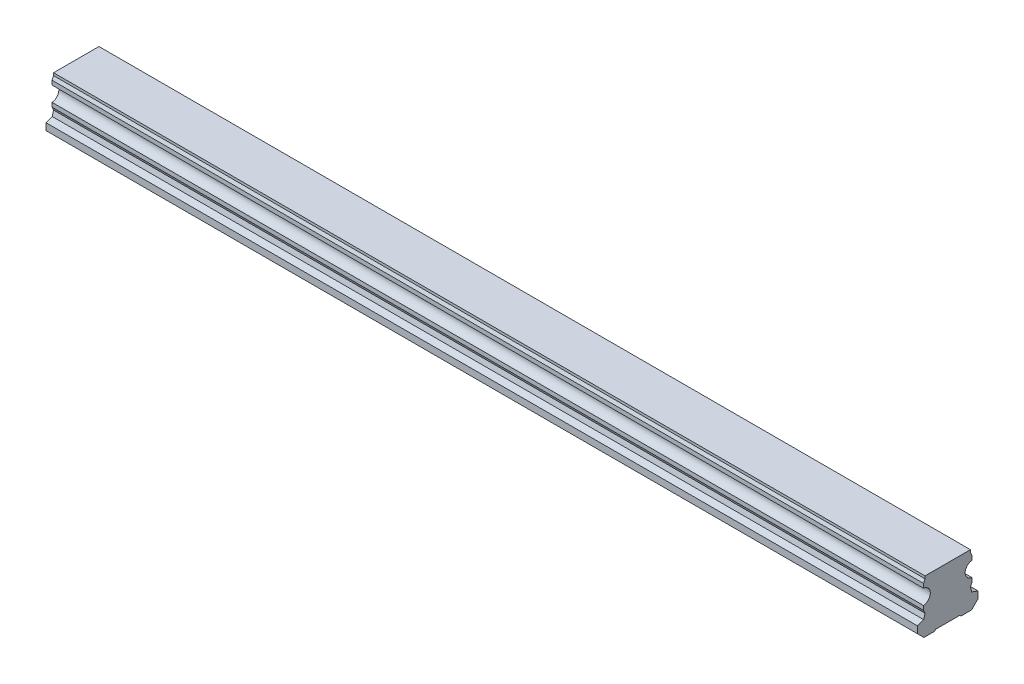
ISO-10303-21;
HEADER;
FILE_DESCRIPTION(('STEP AP214'),'2;1');
FILE_NAME('part.step','',(''),(''),'','','');
FILE_SCHEMA(('AUTOMOTIVE_DESIGN { 1 0 10303 214 1 1 1 1 }'));
ENDSEC;
DATA;
#1=APPLICATION_CONTEXT('core data for automotive mechanical design processes');
#2=APPLICATION_PROTOCOL_DEFINITION('international standard','automotive_design',2000,#1);
#3=PRODUCT_CONTEXT('',#1,'mechanical');
#4=PRODUCT('Part','Part','',(#3));
#5=PRODUCT_RELATED_PRODUCT_CATEGORY('part','',(#4));
#6=PRODUCT_DEFINITION_FORMATION('','',#4);
#7=PRODUCT_DEFINITION_CONTEXT('part definition',#1,'design');
#8=PRODUCT_DEFINITION('design','',#6,#7);
#9=PRODUCT_DEFINITION_SHAPE('','',#8);
#10=(LENGTH_UNIT() NAMED_UNIT(*) SI_UNIT(.MILLI.,.METRE.));
#11=(NAMED_UNIT(*) PLANE_ANGLE_UNIT() SI_UNIT($,.RADIAN.));
#12=(NAMED_UNIT(*) SI_UNIT($,.STERADIAN.) SOLID_ANGLE_UNIT());
#13=UNCERTAINTY_MEASURE_WITH_UNIT(LENGTH_MEASURE(1.E-05),#10,'distance_accuracy_value','');
#14=(GEOMETRIC_REPRESENTATION_CONTEXT(3) GLOBAL_UNCERTAINTY_ASSIGNED_CONTEXT((#13)) GLOBAL_UNIT_ASSIGNED_CONTEXT((#10,
#11,#12)) REPRESENTATION_CONTEXT('',''));
#15=CARTESIAN_POINT('',(0.,0.,0.));
#16=DIRECTION('',(0.,0.,1.));
#17=DIRECTION('',(1.,0.,0.));
#18=AXIS2_PLACEMENT_3D('',#15,#16,#17);
#19=CARTESIAN_POINT('',(330.,0.499999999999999,0.));
#20=DIRECTION('',(0.,-1.,0.));
#21=DIRECTION('',(0.,0.,-1.));
#22=AXIS2_PLACEMENT_3D('',#19,#20,#21);
#23=CONICAL_SURFACE('',#22,3.5,0.785398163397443);
#24=CARTESIAN_POINT('',(330.,1.00000000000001,0.));
#25=DIRECTION('',(0.,1.,0.));
#26=DIRECTION('',(0.,0.,1.));
#27=AXIS2_PLACEMENT_3D('',#24,#25,#26);
#28=CIRCLE('',#27,3.);
#29=CARTESIAN_POINT('',(330.,1.00000000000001,3.));
#30=VERTEX_POINT('',#29);
#31=EDGE_CURVE('E11',#30,#30,#28,.F.);
#32=ORIENTED_EDGE('',*,*,#31,.F.);
#33=EDGE_LOOP('',(#32));
#34=FACE_BOUND('',#33,.T.);
#35=CARTESIAN_POINT('',(330.,0.499999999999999,0.));
#36=DIRECTION('',(0.,1.,0.));
#37=DIRECTION('',(0.,0.,1.));
#38=AXIS2_PLACEMENT_3D('',#35,#36,#37);
#39=CIRCLE('',#38,3.5);
#40=CARTESIAN_POINT('',(330.,0.5,3.5));
#41=VERTEX_POINT('',#40);
#42=EDGE_CURVE('E469',#41,#41,#39,.T.);
#43=ORIENTED_EDGE('',*,*,#42,.F.);
#44=EDGE_LOOP('',(#43));
#45=FACE_BOUND('',#44,.T.);
#46=ADVANCED_FACE('F39',(#34,#45),#23,.F.);
#47=CARTESIAN_POINT('',(330.,12.,0.));
#48=DIRECTION('',(0.,-1.,0.));
#49=DIRECTION('',(0.,0.,-1.));
#50=AXIS2_PLACEMENT_3D('',#47,#48,#49);
#51=CYLINDRICAL_SURFACE('',#50,3.);
#52=ORIENTED_EDGE('',*,*,#31,.T.);
#53=EDGE_LOOP('',(#52));
#54=FACE_BOUND('',#53,.T.);
#55=CARTESIAN_POINT('',(330.,12.,0.));
#56=DIRECTION('',(0.,-1.,0.));
#57=DIRECTION('',(0.,0.,-1.));
#58=AXIS2_PLACEMENT_3D('',#55,#56,#57);
#59=CIRCLE('',#58,3.);
#60=CARTESIAN_POINT('',(330.,12.,-3.));
#61=VERTEX_POINT('',#60);
#62=EDGE_CURVE('E49',#61,#61,#59,.T.);
#63=ORIENTED_EDGE('',*,*,#62,.F.);
#64=EDGE_LOOP('',(#63));
#65=FACE_BOUND('',#64,.T.);
#66=ADVANCED_FACE('F619',(#54,#65),#51,.F.);
#67=CARTESIAN_POINT('',(330.,12.,0.));
#68=DIRECTION('',(0.,-1.,0.));
#69=DIRECTION('',(0.,0.,-1.));
#70=AXIS2_PLACEMENT_3D('',#67,#68,#69);
#71=PLANE('',#70);
#72=CARTESIAN_POINT('',(330.,12.,0.));
#73=DIRECTION('',(0.,-1.,0.));
#74=DIRECTION('',(0.,0.,-1.));
#75=AXIS2_PLACEMENT_3D('',#72,#73,#74);
#76=CIRCLE('',#75,2.5);
#77=CARTESIAN_POINT('',(330.,12.,-2.5));
#78=VERTEX_POINT('',#77);
#79=EDGE_CURVE('E42',#78,#78,#76,.T.);
#80=ORIENTED_EDGE('',*,*,#79,.F.);
#81=EDGE_LOOP('',(#80));
#82=FACE_BOUND('',#81,.T.);
#83=ORIENTED_EDGE('',*,*,#62,.T.);
#84=EDGE_LOOP('',(#83));
#85=FACE_BOUND('',#84,.T.);
#86=ADVANCED_FACE('F624',(#82,#85),#71,.T.);
#87=CARTESIAN_POINT('',(270.,0.499999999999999,0.));
#88=DIRECTION('',(0.,-1.,0.));
#89=DIRECTION('',(0.,0.,-1.));
#90=AXIS2_PLACEMENT_3D('',#87,#88,#89);
#91=CONICAL_SURFACE('',#90,3.5,0.785398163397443);
#92=CARTESIAN_POINT('',(270.,1.00000000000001,0.));
#93=DIRECTION('',(0.,1.,0.));
#94=DIRECTION('',(0.,0.,1.));
#95=AXIS2_PLACEMENT_3D('',#92,#93,#94);
#96=CIRCLE('',#95,3.);
#97=CARTESIAN_POINT('',(270.,1.00000000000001,3.));
#98=VERTEX_POINT('',#97);
#99=EDGE_CURVE('E465',#98,#98,#96,.F.);
#100=ORIENTED_EDGE('',*,*,#99,.F.);
#101=EDGE_LOOP('',(#100));
#102=FACE_BOUND('',#101,.T.);
#103=CARTESIAN_POINT('',(270.,0.499999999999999,0.));
#104=DIRECTION('',(0.,1.,0.));
#105=DIRECTION('',(0.,0.,1.));
#106=AXIS2_PLACEMENT_3D('',#103,#104,#105);
#107=CIRCLE('',#106,3.5);
#108=CARTESIAN_POINT('',(270.,0.5,3.5));
#109=VERTEX_POINT('',#108);
#110=EDGE_CURVE('E457',#109,#109,#107,.T.);
#111=ORIENTED_EDGE('',*,*,#110,.F.);
#112=EDGE_LOOP('',(#111));
#113=FACE_BOUND('',#112,.T.);
#114=ADVANCED_FACE('F733',(#102,#113),#91,.F.);
#115=CARTESIAN_POINT('',(270.,12.,0.));
#116=DIRECTION('',(0.,-1.,0.));
#117=DIRECTION('',(0.,0.,-1.));
#118=AXIS2_PLACEMENT_3D('',#115,#116,#117);
#119=CYLINDRICAL_SURFACE('',#118,3.);
#120=ORIENTED_EDGE('',*,*,#99,.T.);
#121=EDGE_LOOP('',(#120));
#122=FACE_BOUND('',#121,.T.);
#123=CARTESIAN_POINT('',(270.,12.,0.));
#124=DIRECTION('',(0.,-1.,0.));
#125=DIRECTION('',(0.,0.,-1.));
#126=AXIS2_PLACEMENT_3D('',#123,#124,#125);
#127=CIRCLE('',#126,3.);
#128=CARTESIAN_POINT('',(270.,12.,-3.));
#129=VERTEX_POINT('',#128);
#130=EDGE_CURVE('E461',#129,#129,#127,.T.);
#131=ORIENTED_EDGE('',*,*,#130,.F.);
#132=EDGE_LOOP('',(#131));
#133=FACE_BOUND('',#132,.T.);
#134=ADVANCED_FACE('F729',(#122,#133),#119,.F.);
#135=CARTESIAN_POINT('',(270.,12.,0.));
#136=DIRECTION('',(0.,-1.,0.));
#137=DIRECTION('',(0.,0.,-1.));
#138=AXIS2_PLACEMENT_3D('',#135,#136,#137);
#139=PLANE('',#138);
#140=CARTESIAN_POINT('',(270.,12.,0.));
#141=DIRECTION('',(0.,-1.,0.));
#142=DIRECTION('',(0.,0.,-1.));
#143=AXIS2_PLACEMENT_3D('',#140,#141,#142);
#144=CIRCLE('',#143,2.5);
#145=CARTESIAN_POINT('',(270.,12.,-2.5));
#146=VERTEX_POINT('',#145);
#147=EDGE_CURVE('E488',#146,#146,#144,.T.);
#148=ORIENTED_EDGE('',*,*,#147,.F.);
#149=EDGE_LOOP('',(#148));
#150=FACE_BOUND('',#149,.T.);
#151=ORIENTED_EDGE('',*,*,#130,.T.);
#152=EDGE_LOOP('',(#151));
#153=FACE_BOUND('',#152,.T.);
#154=ADVANCED_FACE('F725',(#150,#153),#139,.T.);
#155=CARTESIAN_POINT('',(210.,0.499999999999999,0.));
#156=DIRECTION('',(0.,-1.,0.));
#157=DIRECTION('',(0.,0.,-1.));
#158=AXIS2_PLACEMENT_3D('',#155,#156,#157);
#159=CONICAL_SURFACE('',#158,3.5,0.785398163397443);
#160=CARTESIAN_POINT('',(210.,1.00000000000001,0.));
#161=DIRECTION('',(0.,1.,0.));
#162=DIRECTION('',(0.,0.,1.));
#163=AXIS2_PLACEMENT_3D('',#160,#161,#162);
#164=CIRCLE('',#163,3.);
#165=CARTESIAN_POINT('',(210.,1.00000000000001,3.));
#166=VERTEX_POINT('',#165);
#167=EDGE_CURVE('E453',#166,#166,#164,.F.);
#168=ORIENTED_EDGE('',*,*,#167,.F.);
#169=EDGE_LOOP('',(#168));
#170=FACE_BOUND('',#169,.T.);
#171=CARTESIAN_POINT('',(210.,0.499999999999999,0.));
#172=DIRECTION('',(0.,1.,0.));
#173=DIRECTION('',(0.,0.,1.));
#174=AXIS2_PLACEMENT_3D('',#171,#172,#173);
#175=CIRCLE('',#174,3.5);
#176=CARTESIAN_POINT('',(210.,0.5,3.5));
#177=VERTEX_POINT('',#176);
#178=EDGE_CURVE('E445',#177,#177,#175,.T.);
#179=ORIENTED_EDGE('',*,*,#178,.F.);
#180=EDGE_LOOP('',(#179));
#181=FACE_BOUND('',#180,.T.);
#182=ADVANCED_FACE('F721',(#170,#181),#159,.F.);
#183=CARTESIAN_POINT('',(210.,12.,0.));
#184=DIRECTION('',(0.,-1.,0.));
#185=DIRECTION('',(0.,0.,-1.));
#186=AXIS2_PLACEMENT_3D('',#183,#184,#185);
#187=CYLINDRICAL_SURFACE('',#186,3.);
#188=ORIENTED_EDGE('',*,*,#167,.T.);
#189=EDGE_LOOP('',(#188));
#190=FACE_BOUND('',#189,.T.);
#191=CARTESIAN_POINT('',(210.,12.,0.));
#192=DIRECTION('',(0.,-1.,0.));
#193=DIRECTION('',(0.,0.,-1.));
#194=AXIS2_PLACEMENT_3D('',#191,#192,#193);
#195=CIRCLE('',#194,3.);
#196=CARTESIAN_POINT('',(210.,12.,-3.));
#197=VERTEX_POINT('',#196);
#198=EDGE_CURVE('E449',#197,#197,#195,.T.);
#199=ORIENTED_EDGE('',*,*,#198,.F.);
#200=EDGE_LOOP('',(#199));
#201=FACE_BOUND('',#200,.T.);
#202=ADVANCED_FACE('F717',(#190,#201),#187,.F.);
#203=CARTESIAN_POINT('',(210.,12.,0.));
#204=DIRECTION('',(0.,-1.,0.));
#205=DIRECTION('',(0.,0.,-1.));
#206=AXIS2_PLACEMENT_3D('',#203,#204,#205);
#207=PLANE('',#206);
#208=CARTESIAN_POINT('',(210.,12.,0.));
#209=DIRECTION('',(0.,-1.,0.));
#210=DIRECTION('',(0.,0.,-1.));
#211=AXIS2_PLACEMENT_3D('',#208,#209,#210);
#212=CIRCLE('',#211,2.5);
#213=CARTESIAN_POINT('',(210.,12.,-2.5));
#214=VERTEX_POINT('',#213);
#215=EDGE_CURVE('E485',#214,#214,#212,.T.);
#216=ORIENTED_EDGE('',*,*,#215,.F.);
#217=EDGE_LOOP('',(#216));
#218=FACE_BOUND('',#217,.T.);
#219=ORIENTED_EDGE('',*,*,#198,.T.);
#220=EDGE_LOOP('',(#219));
#221=FACE_BOUND('',#220,.T.);
#222=ADVANCED_FACE('F713',(#218,#221),#207,.T.);
#223=CARTESIAN_POINT('',(150.,0.499999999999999,0.));
#224=DIRECTION('',(0.,-1.,0.));
#225=DIRECTION('',(0.,0.,-1.));
#226=AXIS2_PLACEMENT_3D('',#223,#224,#225);
#227=CONICAL_SURFACE('',#226,3.5,0.785398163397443);
#228=CARTESIAN_POINT('',(150.,1.00000000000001,0.));
#229=DIRECTION('',(0.,1.,0.));
#230=DIRECTION('',(0.,0.,1.));
#231=AXIS2_PLACEMENT_3D('',#228,#229,#230);
#232=CIRCLE('',#231,3.);
#233=CARTESIAN_POINT('',(150.,1.00000000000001,3.));
#234=VERTEX_POINT('',#233);
#235=EDGE_CURVE('E441',#234,#234,#232,.F.);
#236=ORIENTED_EDGE('',*,*,#235,.F.);
#237=EDGE_LOOP('',(#236));
#238=FACE_BOUND('',#237,.T.);
#239=CARTESIAN_POINT('',(150.,0.499999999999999,0.));
#240=DIRECTION('',(0.,1.,0.));
#241=DIRECTION('',(0.,0.,1.));
#242=AXIS2_PLACEMENT_3D('',#239,#240,#241);
#243=CIRCLE('',#242,3.5);
#244=CARTESIAN_POINT('',(150.,0.5,3.5));
#245=VERTEX_POINT('',#244);
#246=EDGE_CURVE('E433',#245,#245,#243,.T.);
#247=ORIENTED_EDGE('',*,*,#246,.F.);
#248=EDGE_LOOP('',(#247));
#249=FACE_BOUND('',#248,.T.);
#250=ADVANCED_FACE('F709',(#238,#249),#227,.F.);
#251=CARTESIAN_POINT('',(150.,12.,0.));
#252=DIRECTION('',(0.,-1.,0.));
#253=DIRECTION('',(0.,0.,-1.));
#254=AXIS2_PLACEMENT_3D('',#251,#252,#253);
#255=CYLINDRICAL_SURFACE('',#254,3.);
#256=ORIENTED_EDGE('',*,*,#235,.T.);
#257=EDGE_LOOP('',(#256));
#258=FACE_BOUND('',#257,.T.);
#259=CARTESIAN_POINT('',(150.,12.,0.));
#260=DIRECTION('',(0.,-1.,0.));
#261=DIRECTION('',(0.,0.,-1.));
#262=AXIS2_PLACEMENT_3D('',#259,#260,#261);
#263=CIRCLE('',#262,3.);
#264=CARTESIAN_POINT('',(150.,12.,-3.));
#265=VERTEX_POINT('',#264);
#266=EDGE_CURVE('E437',#265,#265,#263,.T.);
#267=ORIENTED_EDGE('',*,*,#266,.F.);
#268=EDGE_LOOP('',(#267));
#269=FACE_BOUND('',#268,.T.);
#270=ADVANCED_FACE('F705',(#258,#269),#255,.F.);
#271=CARTESIAN_POINT('',(150.,12.,0.));
#272=DIRECTION('',(0.,-1.,0.));
#273=DIRECTION('',(0.,0.,-1.));
#274=AXIS2_PLACEMENT_3D('',#271,#272,#273);
#275=PLANE('',#274);
#276=CARTESIAN_POINT('',(150.,12.,0.));
#277=DIRECTION('',(0.,-1.,0.));
#278=DIRECTION('',(0.,0.,-1.));
#279=AXIS2_PLACEMENT_3D('',#276,#277,#278);
#280=CIRCLE('',#279,2.5);
#281=CARTESIAN_POINT('',(150.,12.,-2.5));
#282=VERTEX_POINT('',#281);
#283=EDGE_CURVE('E480',#282,#282,#280,.T.);
#284=ORIENTED_EDGE('',*,*,#283,.F.);
#285=EDGE_LOOP('',(#284));
#286=FACE_BOUND('',#285,.T.);
#287=ORIENTED_EDGE('',*,*,#266,.T.);
#288=EDGE_LOOP('',(#287));
#289=FACE_BOUND('',#288,.T.);
#290=ADVANCED_FACE('F696',(#286,#289),#275,.T.);
#291=CARTESIAN_POINT('',(360.,21.8,-9.375));
#292=DIRECTION('',(0.,0.,1.));
#293=DIRECTION('',(0.,-1.,0.));
#294=AXIS2_PLACEMENT_3D('',#291,#292,#293);
#295=PLANE('',#294);
#296=DIRECTION('',(0.,1.,0.));
#297=VECTOR('',#296,1.);
#298=CARTESIAN_POINT('',(0.,21.8,-9.375));
#299=LINE('',#298,#297);
#300=CARTESIAN_POINT('',(0.,20.756,-9.375));
#301=VERTEX_POINT('',#300);
#302=CARTESIAN_POINT('',(0.,21.8,-9.375));
#303=VERTEX_POINT('',#302);
#304=EDGE_CURVE('E255',#301,#303,#299,.T.);
#305=ORIENTED_EDGE('',*,*,#304,.T.);
#306=DIRECTION('',(-1.,0.,0.));
#307=VECTOR('',#306,1.);
#308=CARTESIAN_POINT('',(360.,21.8,-9.375));
#309=LINE('',#308,#307);
#310=CARTESIAN_POINT('',(360.,21.8,-9.375));
#311=VERTEX_POINT('',#310);
#312=EDGE_CURVE('E422',#311,#303,#309,.T.);
#313=ORIENTED_EDGE('',*,*,#312,.F.);
#314=DIRECTION('',(0.,1.,0.));
#315=VECTOR('',#314,1.);
#316=CARTESIAN_POINT('',(360.,21.8,-9.375));
#317=LINE('',#316,#315);
#318=CARTESIAN_POINT('',(360.,20.756,-9.375));
#319=VERTEX_POINT('',#318);
#320=EDGE_CURVE('E331',#319,#311,#317,.T.);
#321=ORIENTED_EDGE('',*,*,#320,.F.);
#322=DIRECTION('',(-1.,0.,0.));
#323=VECTOR('',#322,1.);
#324=CARTESIAN_POINT('',(360.,20.756,-9.375));
#325=LINE('',#324,#323);
#326=EDGE_CURVE('E251',#319,#301,#325,.T.);
#327=ORIENTED_EDGE('',*,*,#326,.T.);
#328=EDGE_LOOP('',(#305,#313,#321,#327));
#329=FACE_BOUND('',#328,.T.);
#330=ADVANCED_FACE('F606',(#329),#295,.F.);
#331=CARTESIAN_POINT('',(360.,21.8,-9.375));
#332=DIRECTION('',(0.,-1.,0.));
#333=DIRECTION('',(0.,0.,-1.));
#334=AXIS2_PLACEMENT_3D('',#331,#332,#333);
#335=PLANE('',#334);
#336=DIRECTION('',(0.,0.,1.));
#337=VECTOR('',#336,1.);
#338=CARTESIAN_POINT('',(0.,21.8,-9.375));
#339=LINE('',#338,#337);
#340=CARTESIAN_POINT('',(0.,21.8,9.375));
#341=VERTEX_POINT('',#340);
#342=EDGE_CURVE('E259',#303,#341,#339,.T.);
#343=ORIENTED_EDGE('',*,*,#342,.T.);
#344=DIRECTION('',(-1.,0.,0.));
#345=VECTOR('',#344,1.);
#346=CARTESIAN_POINT('',(360.,21.8,9.375));
#347=LINE('',#346,#345);
#348=CARTESIAN_POINT('',(360.,21.8,9.375));
#349=VERTEX_POINT('',#348);
#350=EDGE_CURVE('E418',#349,#341,#347,.T.);
#351=ORIENTED_EDGE('',*,*,#350,.F.);
#352=DIRECTION('',(0.,0.,1.));
#353=VECTOR('',#352,1.);
#354=CARTESIAN_POINT('',(360.,21.8,-9.375));
#355=LINE('',#354,#353);
#356=EDGE_CURVE('E157',#311,#349,#355,.T.);
#357=ORIENTED_EDGE('',*,*,#356,.F.);
#358=ORIENTED_EDGE('',*,*,#312,.T.);
#359=EDGE_LOOP('',(#343,#351,#357,#358));
#360=FACE_BOUND('',#359,.T.);
#361=ADVANCED_FACE('F690',(#360),#335,.F.);
#362=CARTESIAN_POINT('',(360.,21.8,9.375));
#363=DIRECTION('',(0.,0.,-1.));
#364=DIRECTION('',(0.,1.,0.));
#365=AXIS2_PLACEMENT_3D('',#362,#363,#364);
#366=PLANE('',#365);
#367=DIRECTION('',(0.,-1.,0.));
#368=VECTOR('',#367,1.);
#369=CARTESIAN_POINT('',(0.,21.8,9.375));
#370=LINE('',#369,#368);
#371=CARTESIAN_POINT('',(0.,20.756,9.37499999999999));
#372=VERTEX_POINT('',#371);
#373=EDGE_CURVE('E263',#341,#372,#370,.T.);
#374=ORIENTED_EDGE('',*,*,#373,.T.);
#375=DIRECTION('',(-1.,0.,0.));
#376=VECTOR('',#375,1.);
#377=CARTESIAN_POINT('',(360.,20.756,9.37499999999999));
#378=LINE('',#377,#376);
#379=CARTESIAN_POINT('',(360.,20.756,9.37499999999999));
#380=VERTEX_POINT('',#379);
#381=EDGE_CURVE('E414',#380,#372,#378,.T.);
#382=ORIENTED_EDGE('',*,*,#381,.F.);
#383=DIRECTION('',(0.,-1.,0.));
#384=VECTOR('',#383,1.);
#385=CARTESIAN_POINT('',(360.,21.8,9.375));
#386=LINE('',#385,#384);
#387=EDGE_CURVE('E530',#349,#380,#386,.T.);
#388=ORIENTED_EDGE('',*,*,#387,.F.);
#389=ORIENTED_EDGE('',*,*,#350,.T.);
#390=EDGE_LOOP('',(#374,#382,#388,#389));
#391=FACE_BOUND('',#390,.T.);
#392=ADVANCED_FACE('F686',(#391),#366,.F.);
#393=CARTESIAN_POINT('',(360.,20.756,9.37499999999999));
#394=DIRECTION('',(0.,-0.422618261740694,-0.906307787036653));
#395=DIRECTION('',(0.,0.906307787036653,-0.422618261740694));
#396=AXIS2_PLACEMENT_3D('',#393,#394,#395);
#397=PLANE('',#396);
#398=DIRECTION('',(0.,-0.906307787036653,0.422618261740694));
#399=VECTOR('',#398,1.);
#400=CARTESIAN_POINT('',(0.,20.756,9.37499999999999));
#401=LINE('',#400,#399);
#402=CARTESIAN_POINT('',(0.,19.4156831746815,10.));
#403=VERTEX_POINT('',#402);
#404=EDGE_CURVE('E266',#372,#403,#401,.T.);
#405=ORIENTED_EDGE('',*,*,#404,.T.);
#406=DIRECTION('',(-1.,0.,0.));
#407=VECTOR('',#406,1.);
#408=CARTESIAN_POINT('',(360.,19.4156831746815,10.));
#409=LINE('',#408,#407);
#410=CARTESIAN_POINT('',(360.,19.4156831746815,10.));
#411=VERTEX_POINT('',#410);
#412=EDGE_CURVE('E410',#411,#403,#409,.T.);
#413=ORIENTED_EDGE('',*,*,#412,.F.);
#414=DIRECTION('',(0.,-0.906307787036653,0.422618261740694));
#415=VECTOR('',#414,1.);
#416=CARTESIAN_POINT('',(360.,20.756,9.37499999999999));
#417=LINE('',#416,#415);
#418=EDGE_CURVE('E533',#380,#411,#417,.T.);
#419=ORIENTED_EDGE('',*,*,#418,.F.);
#420=ORIENTED_EDGE('',*,*,#381,.T.);
#421=EDGE_LOOP('',(#405,#413,#419,#420));
#422=FACE_BOUND('',#421,.T.);
#423=ADVANCED_FACE('F682',(#422),#397,.F.);
#424=CARTESIAN_POINT('',(360.,19.4156831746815,10.));
#425=DIRECTION('',(0.,0.,-1.));
#426=DIRECTION('',(-1.,0.,0.));
#427=AXIS2_PLACEMENT_3D('',#424,#425,#426);
#428=PLANE('',#427);
#429=DIRECTION('',(0.,-1.,0.));
#430=VECTOR('',#429,1.);
#431=CARTESIAN_POINT('',(0.,19.4156831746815,10.));
#432=LINE('',#431,#430);
#433=CARTESIAN_POINT('',(0.,17.6854497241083,10.));
#434=VERTEX_POINT('',#433);
#435=EDGE_CURVE('E269',#403,#434,#432,.T.);
#436=ORIENTED_EDGE('',*,*,#435,.T.);
#437=DIRECTION('',(-1.,0.,0.));
#438=VECTOR('',#437,1.);
#439=CARTESIAN_POINT('',(360.,17.6854497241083,10.));
#440=LINE('',#439,#438);
#441=CARTESIAN_POINT('',(360.,17.6854497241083,10.));
#442=VERTEX_POINT('',#441);
#443=EDGE_CURVE('E406',#442,#434,#440,.T.);
#444=ORIENTED_EDGE('',*,*,#443,.F.);
#445=DIRECTION('',(0.,-1.,0.));
#446=VECTOR('',#445,1.);
#447=CARTESIAN_POINT('',(360.,19.4156831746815,10.));
#448=LINE('',#447,#446);
#449=EDGE_CURVE('E536',#411,#442,#448,.T.);
#450=ORIENTED_EDGE('',*,*,#449,.F.);
#451=ORIENTED_EDGE('',*,*,#412,.T.);
#452=EDGE_LOOP('',(#436,#444,#450,#451));
#453=FACE_BOUND('',#452,.T.);
#454=ADVANCED_FACE('F678',(#453),#428,.F.);
#455=CARTESIAN_POINT('',(360.,14.6,10.3));
#456=DIRECTION('',(-1.,0.,0.));
#457=DIRECTION('',(0.,0.,1.));
#458=AXIS2_PLACEMENT_3D('',#455,#456,#457);
#459=CYLINDRICAL_SURFACE('',#458,3.1);
#460=CARTESIAN_POINT('',(0.,14.6,10.3));
#461=DIRECTION('',(-1.,0.,0.));
#462=DIRECTION('',(0.,0.,-1.));
#463=AXIS2_PLACEMENT_3D('',#460,#461,#462);
#464=CIRCLE('',#463,3.1);
#465=CARTESIAN_POINT('',(0.,11.5145502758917,10.));
#466=VERTEX_POINT('',#465);
#467=EDGE_CURVE('E272',#434,#466,#464,.T.);
#468=ORIENTED_EDGE('',*,*,#467,.T.);
#469=DIRECTION('',(-1.,0.,0.));
#470=VECTOR('',#469,1.);
#471=CARTESIAN_POINT('',(360.,11.5145502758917,10.));
#472=LINE('',#471,#470);
#473=CARTESIAN_POINT('',(360.,11.5145502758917,10.));
#474=VERTEX_POINT('',#473);
#475=EDGE_CURVE('E402',#474,#466,#472,.T.);
#476=ORIENTED_EDGE('',*,*,#475,.F.);
#477=CARTESIAN_POINT('',(360.,14.6,10.3));
#478=DIRECTION('',(-1.,0.,0.));
#479=DIRECTION('',(0.,0.,-1.));
#480=AXIS2_PLACEMENT_3D('',#477,#478,#479);
#481=CIRCLE('',#480,3.1);
#482=EDGE_CURVE('E539',#442,#474,#481,.T.);
#483=ORIENTED_EDGE('',*,*,#482,.F.);
#484=ORIENTED_EDGE('',*,*,#443,.T.);
#485=EDGE_LOOP('',(#468,#476,#483,#484));
#486=FACE_BOUND('',#485,.T.);
#487=ADVANCED_FACE('F674',(#486),#459,.F.);
#488=CARTESIAN_POINT('',(360.,9.78431682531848,10.));
#489=DIRECTION('',(0.,0.,-1.));
#490=DIRECTION('',(0.,1.,0.));
#491=AXIS2_PLACEMENT_3D('',#488,#489,#490);
#492=PLANE('',#491);
#493=DIRECTION('',(0.,-1.,0.));
#494=VECTOR('',#493,1.);
#495=CARTESIAN_POINT('',(0.,9.78431682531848,10.));
#496=LINE('',#495,#494);
#497=CARTESIAN_POINT('',(0.,9.78431682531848,10.));
#498=VERTEX_POINT('',#497);
#499=EDGE_CURVE('E275',#466,#498,#496,.T.);
#500=ORIENTED_EDGE('',*,*,#499,.T.);
#501=DIRECTION('',(-1.,0.,0.));
#502=VECTOR('',#501,1.);
#503=CARTESIAN_POINT('',(360.,9.78431682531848,10.));
#504=LINE('',#503,#502);
#505=CARTESIAN_POINT('',(360.,9.78431682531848,10.));
#506=VERTEX_POINT('',#505);
#507=EDGE_CURVE('E398',#506,#498,#504,.T.);
#508=ORIENTED_EDGE('',*,*,#507,.F.);
#509=DIRECTION('',(0.,-1.,0.));
#510=VECTOR('',#509,1.);
#511=CARTESIAN_POINT('',(360.,9.78431682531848,10.));
#512=LINE('',#511,#510);
#513=EDGE_CURVE('E542',#474,#506,#512,.T.);
#514=ORIENTED_EDGE('',*,*,#513,.F.);
#515=ORIENTED_EDGE('',*,*,#475,.T.);
#516=EDGE_LOOP('',(#500,#508,#514,#515));
#517=FACE_BOUND('',#516,.T.);
#518=ADVANCED_FACE('F670',(#517),#492,.F.);
#519=CARTESIAN_POINT('',(360.,8.44400000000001,9.375));
#520=DIRECTION('',(0.,0.4226182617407,-0.90630778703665));
#521=DIRECTION('',(0.,0.90630778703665,0.4226182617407));
#522=AXIS2_PLACEMENT_3D('',#519,#520,#521);
#523=PLANE('',#522);
#524=DIRECTION('',(0.,-0.90630778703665,-0.4226182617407));
#525=VECTOR('',#524,1.);
#526=CARTESIAN_POINT('',(0.,8.44400000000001,9.375));
#527=LINE('',#526,#525);
#528=CARTESIAN_POINT('',(0.,8.44400000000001,9.375));
#529=VERTEX_POINT('',#528);
#530=EDGE_CURVE('E278',#498,#529,#527,.T.);
#531=ORIENTED_EDGE('',*,*,#530,.T.);
#532=DIRECTION('',(-1.,0.,0.));
#533=VECTOR('',#532,1.);
#534=CARTESIAN_POINT('',(360.,8.44400000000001,9.375));
#535=LINE('',#534,#533);
#536=CARTESIAN_POINT('',(360.,8.44400000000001,9.375));
#537=VERTEX_POINT('',#536);
#538=EDGE_CURVE('E394',#537,#529,#535,.T.);
#539=ORIENTED_EDGE('',*,*,#538,.F.);
#540=DIRECTION('',(0.,-0.90630778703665,-0.4226182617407));
#541=VECTOR('',#540,1.);
#542=CARTESIAN_POINT('',(360.,8.44400000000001,9.375));
#543=LINE('',#542,#541);
#544=EDGE_CURVE('E545',#506,#537,#543,.T.);
#545=ORIENTED_EDGE('',*,*,#544,.F.);
#546=ORIENTED_EDGE('',*,*,#507,.T.);
#547=EDGE_LOOP('',(#531,#539,#545,#546));
#548=FACE_BOUND('',#547,.T.);
#549=ADVANCED_FACE('F666',(#548),#523,.F.);
#550=CARTESIAN_POINT('',(360.,6.4,9.92268814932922));
#551=DIRECTION('',(0.,-0.258819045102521,-0.965925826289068));
#552=DIRECTION('',(0.,0.965925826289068,-0.258819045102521));
#553=AXIS2_PLACEMENT_3D('',#550,#551,#552);
#554=PLANE('',#553);
#555=DIRECTION('',(0.,-0.965925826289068,0.258819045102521));
#556=VECTOR('',#555,1.);
#557=CARTESIAN_POINT('',(0.,6.4,9.92268814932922));
#558=LINE('',#557,#556);
#559=CARTESIAN_POINT('',(0.,6.4,9.92268814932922));
#560=VERTEX_POINT('',#559);
#561=EDGE_CURVE('E281',#529,#560,#558,.T.);
#562=ORIENTED_EDGE('',*,*,#561,.T.);
#563=DIRECTION('',(-1.,0.,0.));
#564=VECTOR('',#563,1.);
#565=CARTESIAN_POINT('',(360.,6.4,9.92268814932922));
#566=LINE('',#565,#564);
#567=CARTESIAN_POINT('',(360.,6.4,9.92268814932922));
#568=VERTEX_POINT('',#567);
#569=EDGE_CURVE('E390',#568,#560,#566,.T.);
#570=ORIENTED_EDGE('',*,*,#569,.F.);
#571=DIRECTION('',(0.,-0.965925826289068,0.258819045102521));
#572=VECTOR('',#571,1.);
#573=CARTESIAN_POINT('',(360.,6.4,9.92268814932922));
#574=LINE('',#573,#572);
#575=EDGE_CURVE('E548',#537,#568,#574,.T.);
#576=ORIENTED_EDGE('',*,*,#575,.F.);
#577=ORIENTED_EDGE('',*,*,#538,.T.);
#578=EDGE_LOOP('',(#562,#570,#576,#577));
#579=FACE_BOUND('',#578,.T.);
#580=ADVANCED_FACE('F662',(#579),#554,.F.);
#581=CARTESIAN_POINT('',(360.,5.48933857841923,12.5));
#582=DIRECTION('',(0.,-0.942872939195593,-0.333152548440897));
#583=DIRECTION('',(0.,0.333152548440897,-0.942872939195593));
#584=AXIS2_PLACEMENT_3D('',#581,#582,#583);
#585=PLANE('',#584);
#586=DIRECTION('',(0.,-0.333152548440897,0.942872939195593));
#587=VECTOR('',#586,1.);
#588=CARTESIAN_POINT('',(0.,5.48933857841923,12.5));
#589=LINE('',#588,#587);
#590=CARTESIAN_POINT('',(0.,5.48933857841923,12.5));
#591=VERTEX_POINT('',#590);
#592=EDGE_CURVE('E284',#560,#591,#589,.T.);
#593=ORIENTED_EDGE('',*,*,#592,.T.);
#594=DIRECTION('',(-1.,0.,0.));
#595=VECTOR('',#594,1.);
#596=CARTESIAN_POINT('',(360.,5.48933857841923,12.5));
#597=LINE('',#596,#595);
#598=CARTESIAN_POINT('',(360.,5.48933857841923,12.5));
#599=VERTEX_POINT('',#598);
#600=EDGE_CURVE('E386',#599,#591,#597,.T.);
#601=ORIENTED_EDGE('',*,*,#600,.F.);
#602=DIRECTION('',(0.,-0.333152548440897,0.942872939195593));
#603=VECTOR('',#602,1.);
#604=CARTESIAN_POINT('',(360.,5.48933857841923,12.5));
#605=LINE('',#604,#603);
#606=EDGE_CURVE('E551',#568,#599,#605,.T.);
#607=ORIENTED_EDGE('',*,*,#606,.F.);
#608=ORIENTED_EDGE('',*,*,#569,.T.);
#609=EDGE_LOOP('',(#593,#601,#607,#608));
#610=FACE_BOUND('',#609,.T.);
#611=ADVANCED_FACE('F658',(#610),#585,.F.);
#612=CARTESIAN_POINT('',(360.,2.65,12.5));
#613=DIRECTION('',(0.,0.,-1.));
#614=DIRECTION('',(0.,1.,0.));
#615=AXIS2_PLACEMENT_3D('',#612,#613,#614);
#616=PLANE('',#615);
#617=DIRECTION('',(0.,-1.,0.));
#618=VECTOR('',#617,1.);
#619=CARTESIAN_POINT('',(0.,2.65,12.5));
#620=LINE('',#619,#618);
#621=CARTESIAN_POINT('',(0.,2.65,12.5));
#622=VERTEX_POINT('',#621);
#623=EDGE_CURVE('E287',#591,#622,#620,.T.);
#624=ORIENTED_EDGE('',*,*,#623,.T.);
#625=DIRECTION('',(-1.,0.,0.));
#626=VECTOR('',#625,1.);
#627=CARTESIAN_POINT('',(360.,2.65,12.5));
#628=LINE('',#627,#626);
#629=CARTESIAN_POINT('',(360.,2.65,12.5));
#630=VERTEX_POINT('',#629);
#631=EDGE_CURVE('E382',#630,#622,#628,.T.);
#632=ORIENTED_EDGE('',*,*,#631,.F.);
#633=DIRECTION('',(0.,-1.,0.));
#634=VECTOR('',#633,1.);
#635=CARTESIAN_POINT('',(360.,2.65,12.5));
#636=LINE('',#635,#634);
#637=EDGE_CURVE('E554',#599,#630,#636,.T.);
#638=ORIENTED_EDGE('',*,*,#637,.F.);
#639=ORIENTED_EDGE('',*,*,#600,.T.);
#640=EDGE_LOOP('',(#624,#632,#638,#639));
#641=FACE_BOUND('',#640,.T.);
#642=ADVANCED_FACE('F654',(#641),#616,.F.);
#643=CARTESIAN_POINT('',(360.,0.,9.85));
#644=DIRECTION('',(0.,0.707106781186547,-0.707106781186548));
#645=DIRECTION('',(0.,0.707106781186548,0.707106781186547));
#646=AXIS2_PLACEMENT_3D('',#643,#644,#645);
#647=PLANE('',#646);
#648=DIRECTION('',(0.,-0.707106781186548,-0.707106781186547));
#649=VECTOR('',#648,1.);
#650=CARTESIAN_POINT('',(0.,0.,9.85));
#651=LINE('',#650,#649);
#652=CARTESIAN_POINT('',(0.,0.,9.85));
#653=VERTEX_POINT('',#652);
#654=EDGE_CURVE('E290',#622,#653,#651,.T.);
#655=ORIENTED_EDGE('',*,*,#654,.T.);
#656=DIRECTION('',(-1.,0.,0.));
#657=VECTOR('',#656,1.);
#658=CARTESIAN_POINT('',(360.,0.,9.85));
#659=LINE('',#658,#657);
#660=CARTESIAN_POINT('',(360.,0.,9.85));
#661=VERTEX_POINT('',#660);
#662=EDGE_CURVE('E378',#661,#653,#659,.T.);
#663=ORIENTED_EDGE('',*,*,#662,.F.);
#664=DIRECTION('',(0.,-0.707106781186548,-0.707106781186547));
#665=VECTOR('',#664,1.);
#666=CARTESIAN_POINT('',(360.,0.,9.85));
#667=LINE('',#666,#665);
#668=EDGE_CURVE('E557',#630,#661,#667,.T.);
#669=ORIENTED_EDGE('',*,*,#668,.F.);
#670=ORIENTED_EDGE('',*,*,#631,.T.);
#671=EDGE_LOOP('',(#655,#663,#669,#670));
#672=FACE_BOUND('',#671,.T.);
#673=ADVANCED_FACE('F650',(#672),#647,.F.);
#674=CARTESIAN_POINT('',(360.,0.,5.5));
#675=DIRECTION('',(0.,1.,0.));
#676=DIRECTION('',(0.,0.,1.));
#677=AXIS2_PLACEMENT_3D('',#674,#675,#676);
#678=PLANE('',#677);
#679=DIRECTION('',(0.,0.,-1.));
#680=VECTOR('',#679,1.);
#681=CARTESIAN_POINT('',(0.,0.,5.5));
#682=LINE('',#681,#680);
#683=CARTESIAN_POINT('',(0.,0.,5.5));
#684=VERTEX_POINT('',#683);
#685=EDGE_CURVE('E293',#653,#684,#682,.T.);
#686=ORIENTED_EDGE('',*,*,#685,.T.);
#687=DIRECTION('',(-1.,0.,0.));
#688=VECTOR('',#687,1.);
#689=CARTESIAN_POINT('',(360.,0.,5.5));
#690=LINE('',#689,#688);
#691=CARTESIAN_POINT('',(360.,0.,5.5));
#692=VERTEX_POINT('',#691);
#693=EDGE_CURVE('E374',#692,#684,#690,.T.);
#694=ORIENTED_EDGE('',*,*,#693,.F.);
#695=DIRECTION('',(0.,0.,-1.));
#696=VECTOR('',#695,1.);
#697=CARTESIAN_POINT('',(360.,0.,5.5));
#698=LINE('',#697,#696);
#699=EDGE_CURVE('E560',#661,#692,#698,.T.);
#700=ORIENTED_EDGE('',*,*,#699,.F.);
#701=ORIENTED_EDGE('',*,*,#662,.T.);
#702=EDGE_LOOP('',(#686,#694,#700,#701));
#703=FACE_BOUND('',#702,.T.);
#704=ADVANCED_FACE('F642',(#703),#678,.F.);
#705=CARTESIAN_POINT('',(360.,0.5,5.));
#706=DIRECTION('',(0.,0.707106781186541,0.707106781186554));
#707=DIRECTION('',(0.,-0.707106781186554,0.707106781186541));
#708=AXIS2_PLACEMENT_3D('',#705,#706,#707);
#709=PLANE('',#708);
#710=DIRECTION('',(0.,0.707106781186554,-0.707106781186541));
#711=VECTOR('',#710,1.);
#712=CARTESIAN_POINT('',(0.,0.5,5.));
#713=LINE('',#712,#711);
#714=CARTESIAN_POINT('',(0.,0.5,5.));
#715=VERTEX_POINT('',#714);
#716=EDGE_CURVE('E296',#684,#715,#713,.T.);
#717=ORIENTED_EDGE('',*,*,#716,.T.);
#718=DIRECTION('',(-1.,0.,0.));
#719=VECTOR('',#718,1.);
#720=CARTESIAN_POINT('',(360.,0.5,5.));
#721=LINE('',#720,#719);
#722=CARTESIAN_POINT('',(360.,0.5,5.));
#723=VERTEX_POINT('',#722);
#724=EDGE_CURVE('E370',#723,#715,#721,.T.);
#725=ORIENTED_EDGE('',*,*,#724,.F.);
#726=DIRECTION('',(0.,0.707106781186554,-0.707106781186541));
#727=VECTOR('',#726,1.);
#728=CARTESIAN_POINT('',(360.,0.5,5.));
#729=LINE('',#728,#727);
#730=EDGE_CURVE('E563',#692,#723,#729,.T.);
#731=ORIENTED_EDGE('',*,*,#730,.F.);
#732=ORIENTED_EDGE('',*,*,#693,.T.);
#733=EDGE_LOOP('',(#717,#725,#731,#732));
#734=FACE_BOUND('',#733,.T.);
#735=ADVANCED_FACE('F633',(#734),#709,.F.);
#736=CARTESIAN_POINT('',(360.,0.499999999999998,-5.));
#737=DIRECTION('',(0.,1.,0.));
#738=DIRECTION('',(0.,0.,1.));
#739=AXIS2_PLACEMENT_3D('',#736,#737,#738);
#740=PLANE('',#739);
#741=CARTESIAN_POINT('',(90.,0.499999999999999,0.));
#742=DIRECTION('',(0.,1.,0.));
#743=DIRECTION('',(0.,0.,1.));
#744=AXIS2_PLACEMENT_3D('',#741,#742,#743);
#745=CIRCLE('',#744,3.5);
#746=CARTESIAN_POINT('',(90.,0.5,3.5));
#747=VERTEX_POINT('',#746);
#748=EDGE_CURVE('E495',#747,#747,#745,.T.);
#749=ORIENTED_EDGE('',*,*,#748,.T.);
#750=EDGE_LOOP('',(#749));
#751=FACE_BOUND('',#750,.T.);
#752=CARTESIAN_POINT('',(30.,0.499999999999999,0.));
#753=DIRECTION('',(0.,1.,0.));
#754=DIRECTION('',(0.,0.,1.));
#755=AXIS2_PLACEMENT_3D('',#752,#753,#754);
#756=CIRCLE('',#755,3.5);
#757=CARTESIAN_POINT('',(30.,0.5,3.5));
#758=VERTEX_POINT('',#757);
#759=EDGE_CURVE('E425',#758,#758,#756,.T.);
#760=ORIENTED_EDGE('',*,*,#759,.T.);
#761=EDGE_LOOP('',(#760));
#762=FACE_BOUND('',#761,.T.);
#763=DIRECTION('',(0.,0.,-1.));
#764=VECTOR('',#763,1.);
#765=CARTESIAN_POINT('',(0.,0.499999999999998,-5.));
#766=LINE('',#765,#764);
#767=CARTESIAN_POINT('',(0.,0.499999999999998,-5.));
#768=VERTEX_POINT('',#767);
#769=EDGE_CURVE('E299',#715,#768,#766,.T.);
#770=ORIENTED_EDGE('',*,*,#769,.T.);
#771=DIRECTION('',(-1.,0.,0.));
#772=VECTOR('',#771,1.);
#773=CARTESIAN_POINT('',(360.,0.499999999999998,-5.));
#774=LINE('',#773,#772);
#775=CARTESIAN_POINT('',(360.,0.499999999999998,-5.));
#776=VERTEX_POINT('',#775);
#777=EDGE_CURVE('E366',#776,#768,#774,.T.);
#778=ORIENTED_EDGE('',*,*,#777,.F.);
#779=DIRECTION('',(0.,0.,-1.));
#780=VECTOR('',#779,1.);
#781=CARTESIAN_POINT('',(360.,0.499999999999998,-5.));
#782=LINE('',#781,#780);
#783=EDGE_CURVE('E566',#723,#776,#782,.T.);
#784=ORIENTED_EDGE('',*,*,#783,.F.);
#785=ORIENTED_EDGE('',*,*,#724,.T.);
#786=EDGE_LOOP('',(#770,#778,#784,#785));
#787=FACE_BOUND('',#786,.T.);
#788=ORIENTED_EDGE('',*,*,#246,.T.);
#789=EDGE_LOOP('',(#788));
#790=FACE_BOUND('',#789,.T.);
#791=ORIENTED_EDGE('',*,*,#178,.T.);
#792=EDGE_LOOP('',(#791));
#793=FACE_BOUND('',#792,.T.);
#794=ORIENTED_EDGE('',*,*,#110,.T.);
#795=EDGE_LOOP('',(#794));
#796=FACE_BOUND('',#795,.T.);
#797=ORIENTED_EDGE('',*,*,#42,.T.);
#798=EDGE_LOOP('',(#797));
#799=FACE_BOUND('',#798,.T.);
#800=ADVANCED_FACE('F630',(#751,#762,#787,#790,#793,#796,#799),#740,.F.);
#801=CARTESIAN_POINT('',(360.,0.,-5.5));
#802=DIRECTION('',(0.,0.707106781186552,-0.707106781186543));
#803=DIRECTION('',(0.,0.707106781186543,0.707106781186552));
#804=AXIS2_PLACEMENT_3D('',#801,#802,#803);
#805=PLANE('',#804);
#806=DIRECTION('',(0.,-0.707106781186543,-0.707106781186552));
#807=VECTOR('',#806,1.);
#808=CARTESIAN_POINT('',(0.,0.,-5.5));
#809=LINE('',#808,#807);
#810=CARTESIAN_POINT('',(0.,0.,-5.5));
#811=VERTEX_POINT('',#810);
#812=EDGE_CURVE('E302',#768,#811,#809,.T.);
#813=ORIENTED_EDGE('',*,*,#812,.T.);
#814=DIRECTION('',(-1.,0.,0.));
#815=VECTOR('',#814,1.);
#816=CARTESIAN_POINT('',(360.,0.,-5.5));
#817=LINE('',#816,#815);
#818=CARTESIAN_POINT('',(360.,0.,-5.5));
#819=VERTEX_POINT('',#818);
#820=EDGE_CURVE('E362',#819,#811,#817,.T.);
#821=ORIENTED_EDGE('',*,*,#820,.F.);
#822=DIRECTION('',(0.,-0.707106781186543,-0.707106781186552));
#823=VECTOR('',#822,1.);
#824=CARTESIAN_POINT('',(360.,0.,-5.5));
#825=LINE('',#824,#823);
#826=EDGE_CURVE('E569',#776,#819,#825,.T.);
#827=ORIENTED_EDGE('',*,*,#826,.F.);
#828=ORIENTED_EDGE('',*,*,#777,.T.);
#829=EDGE_LOOP('',(#813,#821,#827,#828));
#830=FACE_BOUND('',#829,.T.);
#831=ADVANCED_FACE('F632',(#830),#805,.F.);
#832=CARTESIAN_POINT('',(360.,0.,-9.85));
#833=DIRECTION('',(0.,1.,0.));
#834=DIRECTION('',(0.,0.,1.));
#835=AXIS2_PLACEMENT_3D('',#832,#833,#834);
#836=PLANE('',#835);
#837=DIRECTION('',(0.,0.,-1.));
#838=VECTOR('',#837,1.);
#839=CARTESIAN_POINT('',(0.,0.,-9.85));
#840=LINE('',#839,#838);
#841=CARTESIAN_POINT('',(0.,0.,-9.85));
#842=VERTEX_POINT('',#841);
#843=EDGE_CURVE('E305',#811,#842,#840,.T.);
#844=ORIENTED_EDGE('',*,*,#843,.T.);
#845=DIRECTION('',(-1.,0.,0.));
#846=VECTOR('',#845,1.);
#847=CARTESIAN_POINT('',(360.,0.,-9.85));
#848=LINE('',#847,#846);
#849=CARTESIAN_POINT('',(360.,0.,-9.85));
#850=VERTEX_POINT('',#849);
#851=EDGE_CURVE('E358',#850,#842,#848,.T.);
#852=ORIENTED_EDGE('',*,*,#851,.F.);
#853=DIRECTION('',(0.,0.,-1.));
#854=VECTOR('',#853,1.);
#855=CARTESIAN_POINT('',(360.,0.,-9.85));
#856=LINE('',#855,#854);
#857=EDGE_CURVE('E572',#819,#850,#856,.T.);
#858=ORIENTED_EDGE('',*,*,#857,.F.);
#859=ORIENTED_EDGE('',*,*,#820,.T.);
#860=EDGE_LOOP('',(#844,#852,#858,#859));
#861=FACE_BOUND('',#860,.T.);
#862=ADVANCED_FACE('F639',(#861),#836,.F.);
#863=CARTESIAN_POINT('',(360.,2.65,-12.5));
#864=DIRECTION('',(0.,0.707106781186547,0.707106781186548));
#865=DIRECTION('',(0.,-0.707106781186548,0.707106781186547));
#866=AXIS2_PLACEMENT_3D('',#863,#864,#865);
#867=PLANE('',#866);
#868=DIRECTION('',(0.,0.707106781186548,-0.707106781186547));
#869=VECTOR('',#868,1.);
#870=CARTESIAN_POINT('',(0.,2.65,-12.5));
#871=LINE('',#870,#869);
#872=CARTESIAN_POINT('',(0.,2.65,-12.5));
#873=VERTEX_POINT('',#872);
#874=EDGE_CURVE('E308',#842,#873,#871,.T.);
#875=ORIENTED_EDGE('',*,*,#874,.T.);
#876=DIRECTION('',(-1.,0.,0.));
#877=VECTOR('',#876,1.);
#878=CARTESIAN_POINT('',(360.,2.65,-12.5));
#879=LINE('',#878,#877);
#880=CARTESIAN_POINT('',(360.,2.65,-12.5));
#881=VERTEX_POINT('',#880);
#882=EDGE_CURVE('E354',#881,#873,#879,.T.);
#883=ORIENTED_EDGE('',*,*,#882,.F.);
#884=DIRECTION('',(0.,0.707106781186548,-0.707106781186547));
#885=VECTOR('',#884,1.);
#886=CARTESIAN_POINT('',(360.,2.65,-12.5));
#887=LINE('',#886,#885);
#888=EDGE_CURVE('E575',#850,#881,#887,.T.);
#889=ORIENTED_EDGE('',*,*,#888,.F.);
#890=ORIENTED_EDGE('',*,*,#851,.T.);
#891=EDGE_LOOP('',(#875,#883,#889,#890));
#892=FACE_BOUND('',#891,.T.);
#893=ADVANCED_FACE('F832',(#892),#867,.F.);
#894=CARTESIAN_POINT('',(360.,5.48933857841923,-12.5));
#895=DIRECTION('',(0.,0.,1.));
#896=DIRECTION('',(0.,-1.,0.));
#897=AXIS2_PLACEMENT_3D('',#894,#895,#896);
#898=PLANE('',#897);
#899=DIRECTION('',(0.,1.,0.));
#900=VECTOR('',#899,1.);
#901=CARTESIAN_POINT('',(0.,5.48933857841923,-12.5));
#902=LINE('',#901,#900);
#903=CARTESIAN_POINT('',(0.,5.48933857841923,-12.5));
#904=VERTEX_POINT('',#903);
#905=EDGE_CURVE('E311',#873,#904,#902,.T.);
#906=ORIENTED_EDGE('',*,*,#905,.T.);
#907=DIRECTION('',(-1.,0.,0.));
#908=VECTOR('',#907,1.);
#909=CARTESIAN_POINT('',(360.,5.48933857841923,-12.5));
#910=LINE('',#909,#908);
#911=CARTESIAN_POINT('',(360.,5.48933857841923,-12.5));
#912=VERTEX_POINT('',#911);
#913=EDGE_CURVE('E350',#912,#904,#910,.T.);
#914=ORIENTED_EDGE('',*,*,#913,.F.);
#915=DIRECTION('',(0.,1.,0.));
#916=VECTOR('',#915,1.);
#917=CARTESIAN_POINT('',(360.,5.48933857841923,-12.5));
#918=LINE('',#917,#916);
#919=EDGE_CURVE('E578',#881,#912,#918,.T.);
#920=ORIENTED_EDGE('',*,*,#919,.F.);
#921=ORIENTED_EDGE('',*,*,#882,.T.);
#922=EDGE_LOOP('',(#906,#914,#920,#921));
#923=FACE_BOUND('',#922,.T.);
#924=ADVANCED_FACE('F840',(#923),#898,.F.);
#925=CARTESIAN_POINT('',(360.,6.39999999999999,-9.92268814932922));
#926=DIRECTION('',(0.,-0.942872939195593,0.333152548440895));
#927=DIRECTION('',(0.,-0.333152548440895,-0.942872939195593));
#928=AXIS2_PLACEMENT_3D('',#925,#926,#927);
#929=PLANE('',#928);
#930=DIRECTION('',(0.,0.333152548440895,0.942872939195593));
#931=VECTOR('',#930,1.);
#932=CARTESIAN_POINT('',(0.,6.39999999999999,-9.92268814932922));
#933=LINE('',#932,#931);
#934=CARTESIAN_POINT('',(0.,6.39999999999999,-9.92268814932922));
#935=VERTEX_POINT('',#934);
#936=EDGE_CURVE('E314',#904,#935,#933,.T.);
#937=ORIENTED_EDGE('',*,*,#936,.T.);
#938=DIRECTION('',(-1.,0.,0.));
#939=VECTOR('',#938,1.);
#940=CARTESIAN_POINT('',(360.,6.39999999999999,-9.92268814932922));
#941=LINE('',#940,#939);
#942=CARTESIAN_POINT('',(360.,6.39999999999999,-9.92268814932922));
#943=VERTEX_POINT('',#942);
#944=EDGE_CURVE('E346',#943,#935,#941,.T.);
#945=ORIENTED_EDGE('',*,*,#944,.F.);
#946=DIRECTION('',(0.,0.333152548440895,0.942872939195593));
#947=VECTOR('',#946,1.);
#948=CARTESIAN_POINT('',(360.,6.39999999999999,-9.92268814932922));
#949=LINE('',#948,#947);
#950=EDGE_CURVE('E581',#912,#943,#949,.T.);
#951=ORIENTED_EDGE('',*,*,#950,.F.);
#952=ORIENTED_EDGE('',*,*,#913,.T.);
#953=EDGE_LOOP('',(#937,#945,#951,#952));
#954=FACE_BOUND('',#953,.T.);
#955=ADVANCED_FACE('F849',(#954),#929,.F.);
#956=CARTESIAN_POINT('',(360.,8.44400000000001,-9.375));
#957=DIRECTION('',(0.,-0.258819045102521,0.965925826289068));
#958=DIRECTION('',(0.,-0.965925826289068,-0.258819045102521));
#959=AXIS2_PLACEMENT_3D('',#956,#957,#958);
#960=PLANE('',#959);
#961=DIRECTION('',(0.,0.965925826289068,0.258819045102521));
#962=VECTOR('',#961,1.);
#963=CARTESIAN_POINT('',(0.,8.44400000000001,-9.375));
#964=LINE('',#963,#962);
#965=CARTESIAN_POINT('',(0.,8.44400000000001,-9.375));
#966=VERTEX_POINT('',#965);
#967=EDGE_CURVE('E316',#935,#966,#964,.T.);
#968=ORIENTED_EDGE('',*,*,#967,.T.);
#969=DIRECTION('',(-1.,0.,0.));
#970=VECTOR('',#969,1.);
#971=CARTESIAN_POINT('',(360.,8.44400000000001,-9.375));
#972=LINE('',#971,#970);
#973=CARTESIAN_POINT('',(360.,8.44400000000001,-9.375));
#974=VERTEX_POINT('',#973);
#975=EDGE_CURVE('E342',#974,#966,#972,.T.);
#976=ORIENTED_EDGE('',*,*,#975,.F.);
#977=DIRECTION('',(0.,0.965925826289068,0.258819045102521));
#978=VECTOR('',#977,1.);
#979=CARTESIAN_POINT('',(360.,8.44400000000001,-9.375));
#980=LINE('',#979,#978);
#981=EDGE_CURVE('E584',#943,#974,#980,.T.);
#982=ORIENTED_EDGE('',*,*,#981,.F.);
#983=ORIENTED_EDGE('',*,*,#944,.T.);
#984=EDGE_LOOP('',(#968,#976,#982,#983));
#985=FACE_BOUND('',#984,.T.);
#986=ADVANCED_FACE('F858',(#985),#960,.F.);
#987=CARTESIAN_POINT('',(360.,9.78431682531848,-10.));
#988=DIRECTION('',(0.,0.4226182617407,0.90630778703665));
#989=DIRECTION('',(0.,-0.90630778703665,0.4226182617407));
#990=AXIS2_PLACEMENT_3D('',#987,#988,#989);
#991=PLANE('',#990);
#992=DIRECTION('',(0.,0.90630778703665,-0.4226182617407));
#993=VECTOR('',#992,1.);
#994=CARTESIAN_POINT('',(0.,9.78431682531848,-10.));
#995=LINE('',#994,#993);
#996=CARTESIAN_POINT('',(0.,9.78431682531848,-10.));
#997=VERTEX_POINT('',#996);
#998=EDGE_CURVE('E319',#966,#997,#995,.T.);
#999=ORIENTED_EDGE('',*,*,#998,.T.);
#1000=DIRECTION('',(-1.,0.,0.));
#1001=VECTOR('',#1000,1.);
#1002=CARTESIAN_POINT('',(360.,9.78431682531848,-10.));
#1003=LINE('',#1002,#1001);
#1004=CARTESIAN_POINT('',(360.,9.78431682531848,-10.));
#1005=VERTEX_POINT('',#1004);
#1006=EDGE_CURVE('E338',#1005,#997,#1003,.T.);
#1007=ORIENTED_EDGE('',*,*,#1006,.F.);
#1008=DIRECTION('',(0.,0.90630778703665,-0.4226182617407));
#1009=VECTOR('',#1008,1.);
#1010=CARTESIAN_POINT('',(360.,9.78431682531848,-10.));
#1011=LINE('',#1010,#1009);
#1012=EDGE_CURVE('E587',#974,#1005,#1011,.T.);
#1013=ORIENTED_EDGE('',*,*,#1012,.F.);
#1014=ORIENTED_EDGE('',*,*,#975,.T.);
#1015=EDGE_LOOP('',(#999,#1007,#1013,#1014));
#1016=FACE_BOUND('',#1015,.T.);
#1017=ADVANCED_FACE('F595',(#1016),#991,.F.);
#1018=CARTESIAN_POINT('',(360.,11.5145502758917,-10.));
#1019=DIRECTION('',(0.,0.,1.));
#1020=DIRECTION('',(1.,0.,0.));
#1021=AXIS2_PLACEMENT_3D('',#1018,#1019,#1020);
#1022=PLANE('',#1021);
#1023=DIRECTION('',(0.,1.,0.));
#1024=VECTOR('',#1023,1.);
#1025=CARTESIAN_POINT('',(0.,11.5145502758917,-10.));
#1026=LINE('',#1025,#1024);
#1027=CARTESIAN_POINT('',(0.,11.5145502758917,-10.));
#1028=VERTEX_POINT('',#1027);
#1029=EDGE_CURVE('E322',#997,#1028,#1026,.T.);
#1030=ORIENTED_EDGE('',*,*,#1029,.T.);
#1031=DIRECTION('',(-1.,0.,0.));
#1032=VECTOR('',#1031,1.);
#1033=CARTESIAN_POINT('',(360.,11.5145502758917,-10.));
#1034=LINE('',#1033,#1032);
#1035=CARTESIAN_POINT('',(360.,11.5145502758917,-10.));
#1036=VERTEX_POINT('',#1035);
#1037=EDGE_CURVE('E243',#1036,#1028,#1034,.T.);
#1038=ORIENTED_EDGE('',*,*,#1037,.F.);
#1039=DIRECTION('',(0.,1.,0.));
#1040=VECTOR('',#1039,1.);
#1041=CARTESIAN_POINT('',(360.,11.5145502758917,-10.));
#1042=LINE('',#1041,#1040);
#1043=EDGE_CURVE('E232',#1005,#1036,#1042,.T.);
#1044=ORIENTED_EDGE('',*,*,#1043,.F.);
#1045=ORIENTED_EDGE('',*,*,#1006,.T.);
#1046=EDGE_LOOP('',(#1030,#1038,#1044,#1045));
#1047=FACE_BOUND('',#1046,.T.);
#1048=ADVANCED_FACE('F599',(#1047),#1022,.F.);
#1049=CARTESIAN_POINT('',(360.,14.6,-10.3));
#1050=DIRECTION('',(-1.,0.,0.));
#1051=DIRECTION('',(0.,0.,1.));
#1052=AXIS2_PLACEMENT_3D('',#1049,#1050,#1051);
#1053=CYLINDRICAL_SURFACE('',#1052,3.1);
#1054=CARTESIAN_POINT('',(0.,14.6,-10.3));
#1055=DIRECTION('',(-1.,0.,0.));
#1056=DIRECTION('',(0.,0.,-1.));
#1057=AXIS2_PLACEMENT_3D('',#1054,#1055,#1056);
#1058=CIRCLE('',#1057,3.1);
#1059=CARTESIAN_POINT('',(0.,17.6854497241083,-10.));
#1060=VERTEX_POINT('',#1059);
#1061=EDGE_CURVE('E241',#1028,#1060,#1058,.T.);
#1062=ORIENTED_EDGE('',*,*,#1061,.T.);
#1063=DIRECTION('',(-1.,0.,0.));
#1064=VECTOR('',#1063,1.);
#1065=CARTESIAN_POINT('',(360.,17.6854497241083,-10.));
#1066=LINE('',#1065,#1064);
#1067=CARTESIAN_POINT('',(360.,17.6854497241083,-10.));
#1068=VERTEX_POINT('',#1067);
#1069=EDGE_CURVE('E238',#1068,#1060,#1066,.T.);
#1070=ORIENTED_EDGE('',*,*,#1069,.F.);
#1071=CARTESIAN_POINT('',(360.,14.6,-10.3));
#1072=DIRECTION('',(-1.,0.,0.));
#1073=DIRECTION('',(0.,0.,-1.));
#1074=AXIS2_PLACEMENT_3D('',#1071,#1072,#1073);
#1075=CIRCLE('',#1074,3.1);
#1076=EDGE_CURVE('E226',#1036,#1068,#1075,.T.);
#1077=ORIENTED_EDGE('',*,*,#1076,.F.);
#1078=ORIENTED_EDGE('',*,*,#1037,.T.);
#1079=EDGE_LOOP('',(#1062,#1070,#1077,#1078));
#1080=FACE_BOUND('',#1079,.T.);
#1081=ADVANCED_FACE('F239',(#1080),#1053,.F.);
#1082=CARTESIAN_POINT('',(360.,19.4156831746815,-10.));
#1083=DIRECTION('',(0.,0.,1.));
#1084=DIRECTION('',(1.,0.,0.));
#1085=AXIS2_PLACEMENT_3D('',#1082,#1083,#1084);
#1086=PLANE('',#1085);
#1087=DIRECTION('',(0.,1.,0.));
#1088=VECTOR('',#1087,1.);
#1089=CARTESIAN_POINT('',(0.,19.4156831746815,-10.));
#1090=LINE('',#1089,#1088);
#1091=CARTESIAN_POINT('',(0.,19.4156831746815,-10.));
#1092=VERTEX_POINT('',#1091);
#1093=EDGE_CURVE('E142',#1060,#1092,#1090,.T.);
#1094=ORIENTED_EDGE('',*,*,#1093,.T.);
#1095=DIRECTION('',(-1.,0.,0.));
#1096=VECTOR('',#1095,1.);
#1097=CARTESIAN_POINT('',(360.,19.4156831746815,-10.));
#1098=LINE('',#1097,#1096);
#1099=CARTESIAN_POINT('',(360.,19.4156831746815,-10.));
#1100=VERTEX_POINT('',#1099);
#1101=EDGE_CURVE('E244',#1100,#1092,#1098,.T.);
#1102=ORIENTED_EDGE('',*,*,#1101,.F.);
#1103=DIRECTION('',(0.,1.,0.));
#1104=VECTOR('',#1103,1.);
#1105=CARTESIAN_POINT('',(360.,19.4156831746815,-10.));
#1106=LINE('',#1105,#1104);
#1107=EDGE_CURVE('E230',#1068,#1100,#1106,.T.);
#1108=ORIENTED_EDGE('',*,*,#1107,.F.);
#1109=ORIENTED_EDGE('',*,*,#1069,.T.);
#1110=EDGE_LOOP('',(#1094,#1102,#1108,#1109));
#1111=FACE_BOUND('',#1110,.T.);
#1112=ADVANCED_FACE('F246',(#1111),#1086,.F.);
#1113=CARTESIAN_POINT('',(360.,20.756,-9.375));
#1114=DIRECTION('',(0.,-0.422618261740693,0.906307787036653));
#1115=DIRECTION('',(0.,-0.906307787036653,-0.422618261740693));
#1116=AXIS2_PLACEMENT_3D('',#1113,#1114,#1115);
#1117=PLANE('',#1116);
#1118=DIRECTION('',(0.,0.906307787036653,0.422618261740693));
#1119=VECTOR('',#1118,1.);
#1120=CARTESIAN_POINT('',(0.,20.756,-9.375));
#1121=LINE('',#1120,#1119);
#1122=EDGE_CURVE('E148',#1092,#301,#1121,.T.);
#1123=ORIENTED_EDGE('',*,*,#1122,.T.);
#1124=ORIENTED_EDGE('',*,*,#326,.F.);
#1125=DIRECTION('',(0.,0.906307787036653,0.422618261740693));
#1126=VECTOR('',#1125,1.);
#1127=CARTESIAN_POINT('',(360.,20.756,-9.375));
#1128=LINE('',#1127,#1126);
#1129=EDGE_CURVE('E58',#1100,#319,#1128,.T.);
#1130=ORIENTED_EDGE('',*,*,#1129,.F.);
#1131=ORIENTED_EDGE('',*,*,#1101,.T.);
#1132=EDGE_LOOP('',(#1123,#1124,#1130,#1131));
#1133=FACE_BOUND('',#1132,.T.);
#1134=ADVANCED_FACE('F608',(#1133),#1117,.F.);
#1135=CARTESIAN_POINT('',(360.,14.6,-10.3));
#1136=DIRECTION('',(1.,0.,0.));
#1137=DIRECTION('',(0.,0.,-1.));
#1138=AXIS2_PLACEMENT_3D('',#1135,#1136,#1137);
#1139=PLANE('',#1138);
#1140=ORIENTED_EDGE('',*,*,#320,.T.);
#1141=ORIENTED_EDGE('',*,*,#356,.T.);
#1142=ORIENTED_EDGE('',*,*,#387,.T.);
#1143=ORIENTED_EDGE('',*,*,#418,.T.);
#1144=ORIENTED_EDGE('',*,*,#449,.T.);
#1145=ORIENTED_EDGE('',*,*,#482,.T.);
#1146=ORIENTED_EDGE('',*,*,#513,.T.);
#1147=ORIENTED_EDGE('',*,*,#544,.T.);
#1148=ORIENTED_EDGE('',*,*,#575,.T.);
#1149=ORIENTED_EDGE('',*,*,#606,.T.);
#1150=ORIENTED_EDGE('',*,*,#637,.T.);
#1151=ORIENTED_EDGE('',*,*,#668,.T.);
#1152=ORIENTED_EDGE('',*,*,#699,.T.);
#1153=ORIENTED_EDGE('',*,*,#730,.T.);
#1154=ORIENTED_EDGE('',*,*,#783,.T.);
#1155=ORIENTED_EDGE('',*,*,#826,.T.);
#1156=ORIENTED_EDGE('',*,*,#857,.T.);
#1157=ORIENTED_EDGE('',*,*,#888,.T.);
#1158=ORIENTED_EDGE('',*,*,#919,.T.);
#1159=ORIENTED_EDGE('',*,*,#950,.T.);
#1160=ORIENTED_EDGE('',*,*,#981,.T.);
#1161=ORIENTED_EDGE('',*,*,#1012,.T.);
#1162=ORIENTED_EDGE('',*,*,#1043,.T.);
#1163=ORIENTED_EDGE('',*,*,#1076,.T.);
#1164=ORIENTED_EDGE('',*,*,#1107,.T.);
#1165=ORIENTED_EDGE('',*,*,#1129,.T.);
#1166=EDGE_LOOP('',(#1140,#1141,#1142,#1143,#1144,#1145,#1146,#1147,#1148,#1149,#1150,#1151,
#1152,#1153,#1154,#1155,#1156,#1157,#1158,#1159,#1160,#1161,#1162,#1163,#1164,#1165));
#1167=FACE_BOUND('',#1166,.T.);
#1168=ADVANCED_FACE('F228',(#1167),#1139,.T.);
#1169=CARTESIAN_POINT('',(0.,14.6,-10.3));
#1170=DIRECTION('',(1.,0.,0.));
#1171=DIRECTION('',(0.,0.,-1.));
#1172=AXIS2_PLACEMENT_3D('',#1169,#1170,#1171);
#1173=PLANE('',#1172);
#1174=ORIENTED_EDGE('',*,*,#304,.F.);
#1175=ORIENTED_EDGE('',*,*,#1122,.F.);
#1176=ORIENTED_EDGE('',*,*,#1093,.F.);
#1177=ORIENTED_EDGE('',*,*,#1061,.F.);
#1178=ORIENTED_EDGE('',*,*,#1029,.F.);
#1179=ORIENTED_EDGE('',*,*,#998,.F.);
#1180=ORIENTED_EDGE('',*,*,#967,.F.);
#1181=ORIENTED_EDGE('',*,*,#936,.F.);
#1182=ORIENTED_EDGE('',*,*,#905,.F.);
#1183=ORIENTED_EDGE('',*,*,#874,.F.);
#1184=ORIENTED_EDGE('',*,*,#843,.F.);
#1185=ORIENTED_EDGE('',*,*,#812,.F.);
#1186=ORIENTED_EDGE('',*,*,#769,.F.);
#1187=ORIENTED_EDGE('',*,*,#716,.F.);
#1188=ORIENTED_EDGE('',*,*,#685,.F.);
#1189=ORIENTED_EDGE('',*,*,#654,.F.);
#1190=ORIENTED_EDGE('',*,*,#623,.F.);
#1191=ORIENTED_EDGE('',*,*,#592,.F.);
#1192=ORIENTED_EDGE('',*,*,#561,.F.);
#1193=ORIENTED_EDGE('',*,*,#530,.F.);
#1194=ORIENTED_EDGE('',*,*,#499,.F.);
#1195=ORIENTED_EDGE('',*,*,#467,.F.);
#1196=ORIENTED_EDGE('',*,*,#435,.F.);
#1197=ORIENTED_EDGE('',*,*,#404,.F.);
#1198=ORIENTED_EDGE('',*,*,#373,.F.);
#1199=ORIENTED_EDGE('',*,*,#342,.F.);
#1200=EDGE_LOOP('',(#1174,#1175,#1176,#1177,#1178,#1179,#1180,#1181,#1182,#1183,#1184,#1185,
#1186,#1187,#1188,#1189,#1190,#1191,#1192,#1193,#1194,#1195,#1196,#1197,#1198,#1199));
#1201=FACE_BOUND('',#1200,.T.);
#1202=ADVANCED_FACE('F602',(#1201),#1173,.F.);
#1203=CARTESIAN_POINT('',(30.,12.,0.));
#1204=DIRECTION('',(0.,-1.,0.));
#1205=DIRECTION('',(0.,0.,-1.));
#1206=AXIS2_PLACEMENT_3D('',#1203,#1204,#1205);
#1207=CYLINDRICAL_SURFACE('',#1206,3.);
#1208=CARTESIAN_POINT('',(30.,1.00000000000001,0.));
#1209=DIRECTION('',(0.,1.,0.));
#1210=DIRECTION('',(0.,0.,1.));
#1211=AXIS2_PLACEMENT_3D('',#1208,#1209,#1210);
#1212=CIRCLE('',#1211,3.);
#1213=CARTESIAN_POINT('',(30.,1.00000000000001,3.));
#1214=VERTEX_POINT('',#1213);
#1215=EDGE_CURVE('E429',#1214,#1214,#1212,.F.);
#1216=ORIENTED_EDGE('',*,*,#1215,.T.);
#1217=EDGE_LOOP('',(#1216));
#1218=FACE_BOUND('',#1217,.T.);
#1219=CARTESIAN_POINT('',(30.,12.,0.));
#1220=DIRECTION('',(0.,-1.,0.));
#1221=DIRECTION('',(0.,0.,-1.));
#1222=AXIS2_PLACEMENT_3D('',#1219,#1220,#1221);
#1223=CIRCLE('',#1222,3.);
#1224=CARTESIAN_POINT('',(30.,12.,-3.));
#1225=VERTEX_POINT('',#1224);
#1226=EDGE_CURVE('E260',#1225,#1225,#1223,.T.);
#1227=ORIENTED_EDGE('',*,*,#1226,.F.);
#1228=EDGE_LOOP('',(#1227));
#1229=FACE_BOUND('',#1228,.T.);
#1230=ADVANCED_FACE('F909',(#1218,#1229),#1207,.F.);
#1231=CARTESIAN_POINT('',(30.,12.,0.));
#1232=DIRECTION('',(0.,-1.,0.));
#1233=DIRECTION('',(0.,0.,-1.));
#1234=AXIS2_PLACEMENT_3D('',#1231,#1232,#1233);
#1235=PLANE('',#1234);
#1236=CARTESIAN_POINT('',(30.,12.,0.));
#1237=DIRECTION('',(0.,-1.,0.));
#1238=DIRECTION('',(0.,0.,-1.));
#1239=AXIS2_PLACEMENT_3D('',#1236,#1237,#1238);
#1240=CIRCLE('',#1239,2.5);
#1241=CARTESIAN_POINT('',(30.,12.,-2.5));
#1242=VERTEX_POINT('',#1241);
#1243=EDGE_CURVE('E519',#1242,#1242,#1240,.T.);
#1244=ORIENTED_EDGE('',*,*,#1243,.F.);
#1245=EDGE_LOOP('',(#1244));
#1246=FACE_BOUND('',#1245,.T.);
#1247=ORIENTED_EDGE('',*,*,#1226,.T.);
#1248=EDGE_LOOP('',(#1247));
#1249=FACE_BOUND('',#1248,.T.);
#1250=ADVANCED_FACE('F917',(#1246,#1249),#1235,.T.);
#1251=CARTESIAN_POINT('',(30.,15.,0.));
#1252=DIRECTION('',(0.,-1.,0.));
#1253=DIRECTION('',(0.,0.,-1.));
#1254=AXIS2_PLACEMENT_3D('',#1251,#1252,#1253);
#1255=CYLINDRICAL_SURFACE('',#1254,2.5);
#1256=ORIENTED_EDGE('',*,*,#1243,.T.);
#1257=EDGE_LOOP('',(#1256));
#1258=FACE_BOUND('',#1257,.T.);
#1259=CARTESIAN_POINT('',(30.,15.,0.));
#1260=DIRECTION('',(0.,-1.,0.));
#1261=DIRECTION('',(0.,0.,-1.));
#1262=AXIS2_PLACEMENT_3D('',#1259,#1260,#1261);
#1263=CIRCLE('',#1262,2.5);
#1264=CARTESIAN_POINT('',(30.,15.,-2.5));
#1265=VERTEX_POINT('',#1264);
#1266=EDGE_CURVE('E515',#1265,#1265,#1263,.T.);
#1267=ORIENTED_EDGE('',*,*,#1266,.F.);
#1268=EDGE_LOOP('',(#1267));
#1269=FACE_BOUND('',#1268,.T.);
#1270=ADVANCED_FACE('F927',(#1258,#1269),#1255,.F.);
#1271=CARTESIAN_POINT('',(30.,15.,0.));
#1272=DIRECTION('',(0.,-1.,0.));
#1273=DIRECTION('',(0.,0.,-1.));
#1274=AXIS2_PLACEMENT_3D('',#1271,#1272,#1273);
#1275=CONICAL_SURFACE('',#1274,2.5,1.0471975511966);
#1276=CARTESIAN_POINT('',(30.,16.4433756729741,0.));
#1277=VERTEX_POINT('',#1276);
#1278=VERTEX_LOOP('',#1277);
#1279=FACE_BOUND('',#1278,.T.);
#1280=ORIENTED_EDGE('',*,*,#1266,.T.);
#1281=EDGE_LOOP('',(#1280));
#1282=FACE_BOUND('',#1281,.T.);
#1283=ADVANCED_FACE('F701',(#1279,#1282),#1275,.F.);
#1284=CARTESIAN_POINT('',(30.,0.499999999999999,0.));
#1285=DIRECTION('',(0.,-1.,0.));
#1286=DIRECTION('',(0.,0.,-1.));
#1287=AXIS2_PLACEMENT_3D('',#1284,#1285,#1286);
#1288=CONICAL_SURFACE('',#1287,3.5,0.785398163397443);
#1289=ORIENTED_EDGE('',*,*,#1215,.F.);
#1290=EDGE_LOOP('',(#1289));
#1291=FACE_BOUND('',#1290,.T.);
#1292=ORIENTED_EDGE('',*,*,#759,.F.);
#1293=EDGE_LOOP('',(#1292));
#1294=FACE_BOUND('',#1293,.T.);
#1295=ADVANCED_FACE('F697',(#1291,#1294),#1288,.F.);
#1296=CARTESIAN_POINT('',(90.,12.,0.));
#1297=DIRECTION('',(0.,-1.,0.));
#1298=DIRECTION('',(0.,0.,-1.));
#1299=AXIS2_PLACEMENT_3D('',#1296,#1297,#1298);
#1300=PLANE('',#1299);
#1301=CARTESIAN_POINT('',(90.,12.,0.));
#1302=DIRECTION('',(0.,-1.,0.));
#1303=DIRECTION('',(0.,0.,-1.));
#1304=AXIS2_PLACEMENT_3D('',#1301,#1302,#1303);
#1305=CIRCLE('',#1304,2.5);
#1306=CARTESIAN_POINT('',(90.,12.,-2.5));
#1307=VERTEX_POINT('',#1306);
#1308=EDGE_CURVE('E476',#1307,#1307,#1305,.T.);
#1309=ORIENTED_EDGE('',*,*,#1308,.F.);
#1310=EDGE_LOOP('',(#1309));
#1311=FACE_BOUND('',#1310,.T.);
#1312=CARTESIAN_POINT('',(90.,12.,0.));
#1313=DIRECTION('',(0.,-1.,0.));
#1314=DIRECTION('',(0.,0.,-1.));
#1315=AXIS2_PLACEMENT_3D('',#1312,#1313,#1314);
#1316=CIRCLE('',#1315,3.);
#1317=CARTESIAN_POINT('',(90.,12.,-3.));
#1318=VERTEX_POINT('',#1317);
#1319=EDGE_CURVE('E506',#1318,#1318,#1316,.T.);
#1320=ORIENTED_EDGE('',*,*,#1319,.T.);
#1321=EDGE_LOOP('',(#1320));
#1322=FACE_BOUND('',#1321,.T.);
#1323=ADVANCED_FACE('F700',(#1311,#1322),#1300,.T.);
#1324=CARTESIAN_POINT('',(90.,12.,0.));
#1325=DIRECTION('',(0.,-1.,0.));
#1326=DIRECTION('',(0.,0.,-1.));
#1327=AXIS2_PLACEMENT_3D('',#1324,#1325,#1326);
#1328=CYLINDRICAL_SURFACE('',#1327,3.);
#1329=CARTESIAN_POINT('',(90.,1.00000000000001,0.));
#1330=DIRECTION('',(0.,1.,0.));
#1331=DIRECTION('',(0.,0.,1.));
#1332=AXIS2_PLACEMENT_3D('',#1329,#1330,#1331);
#1333=CIRCLE('',#1332,3.);
#1334=CARTESIAN_POINT('',(90.,1.00000000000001,3.));
#1335=VERTEX_POINT('',#1334);
#1336=EDGE_CURVE('E500',#1335,#1335,#1333,.F.);
#1337=ORIENTED_EDGE('',*,*,#1336,.T.);
#1338=EDGE_LOOP('',(#1337));
#1339=FACE_BOUND('',#1338,.T.);
#1340=ORIENTED_EDGE('',*,*,#1319,.F.);
#1341=EDGE_LOOP('',(#1340));
#1342=FACE_BOUND('',#1341,.T.);
#1343=ADVANCED_FACE('F955',(#1339,#1342),#1328,.F.);
#1344=CARTESIAN_POINT('',(90.,0.499999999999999,0.));
#1345=DIRECTION('',(0.,-1.,0.));
#1346=DIRECTION('',(0.,0.,-1.));
#1347=AXIS2_PLACEMENT_3D('',#1344,#1345,#1346);
#1348=CONICAL_SURFACE('',#1347,3.5,0.785398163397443);
#1349=ORIENTED_EDGE('',*,*,#1336,.F.);
#1350=EDGE_LOOP('',(#1349));
#1351=FACE_BOUND('',#1350,.T.);
#1352=ORIENTED_EDGE('',*,*,#748,.F.);
#1353=EDGE_LOOP('',(#1352));
#1354=FACE_BOUND('',#1353,.T.);
#1355=ADVANCED_FACE('F964',(#1351,#1354),#1348,.F.);
#1356=CARTESIAN_POINT('',(90.,15.,0.));
#1357=DIRECTION('',(0.,-1.,0.));
#1358=DIRECTION('',(0.,0.,-1.));
#1359=AXIS2_PLACEMENT_3D('',#1356,#1357,#1358);
#1360=CYLINDRICAL_SURFACE('',#1359,2.5);
#1361=ORIENTED_EDGE('',*,*,#1308,.T.);
#1362=EDGE_LOOP('',(#1361));
#1363=FACE_BOUND('',#1362,.T.);
#1364=CARTESIAN_POINT('',(90.,15.,0.));
#1365=DIRECTION('',(0.,-1.,0.));
#1366=DIRECTION('',(0.,0.,-1.));
#1367=AXIS2_PLACEMENT_3D('',#1364,#1365,#1366);
#1368=CIRCLE('',#1367,2.5);
#1369=CARTESIAN_POINT('',(90.,15.,-2.5));
#1370=VERTEX_POINT('',#1369);
#1371=EDGE_CURVE('E481',#1370,#1370,#1368,.T.);
#1372=ORIENTED_EDGE('',*,*,#1371,.F.);
#1373=EDGE_LOOP('',(#1372));
#1374=FACE_BOUND('',#1373,.T.);
#1375=ADVANCED_FACE('F973',(#1363,#1374),#1360,.F.);
#1376=CARTESIAN_POINT('',(150.,15.,0.));
#1377=DIRECTION('',(0.,-1.,0.));
#1378=DIRECTION('',(0.,0.,-1.));
#1379=AXIS2_PLACEMENT_3D('',#1376,#1377,#1378);
#1380=CYLINDRICAL_SURFACE('',#1379,2.5);
#1381=ORIENTED_EDGE('',*,*,#283,.T.);
#1382=EDGE_LOOP('',(#1381));
#1383=FACE_BOUND('',#1382,.T.);
#1384=CARTESIAN_POINT('',(150.,15.,0.));
#1385=DIRECTION('',(0.,-1.,0.));
#1386=DIRECTION('',(0.,0.,-1.));
#1387=AXIS2_PLACEMENT_3D('',#1384,#1385,#1386);
#1388=CIRCLE('',#1387,2.5);
#1389=CARTESIAN_POINT('',(150.,15.,-2.5));
#1390=VERTEX_POINT('',#1389);
#1391=EDGE_CURVE('E1239',#1390,#1390,#1388,.T.);
#1392=ORIENTED_EDGE('',*,*,#1391,.F.);
#1393=EDGE_LOOP('',(#1392));
#1394=FACE_BOUND('',#1393,.T.);
#1395=ADVANCED_FACE('F982',(#1383,#1394),#1380,.F.);
#1396=CARTESIAN_POINT('',(210.,15.,0.));
#1397=DIRECTION('',(0.,-1.,0.));
#1398=DIRECTION('',(0.,0.,-1.));
#1399=AXIS2_PLACEMENT_3D('',#1396,#1397,#1398);
#1400=CYLINDRICAL_SURFACE('',#1399,2.5);
#1401=ORIENTED_EDGE('',*,*,#215,.T.);
#1402=EDGE_LOOP('',(#1401));
#1403=FACE_BOUND('',#1402,.T.);
#1404=CARTESIAN_POINT('',(210.,15.,0.));
#1405=DIRECTION('',(0.,-1.,0.));
#1406=DIRECTION('',(0.,0.,-1.));
#1407=AXIS2_PLACEMENT_3D('',#1404,#1405,#1406);
#1408=CIRCLE('',#1407,2.5);
#1409=CARTESIAN_POINT('',(210.,15.,-2.5));
#1410=VERTEX_POINT('',#1409);
#1411=EDGE_CURVE('E1243',#1410,#1410,#1408,.T.);
#1412=ORIENTED_EDGE('',*,*,#1411,.F.);
#1413=EDGE_LOOP('',(#1412));
#1414=FACE_BOUND('',#1413,.T.);
#1415=ADVANCED_FACE('F991',(#1403,#1414),#1400,.F.);
#1416=CARTESIAN_POINT('',(270.,15.,0.));
#1417=DIRECTION('',(0.,-1.,0.));
#1418=DIRECTION('',(0.,0.,-1.));
#1419=AXIS2_PLACEMENT_3D('',#1416,#1417,#1418);
#1420=CYLINDRICAL_SURFACE('',#1419,2.5);
#1421=ORIENTED_EDGE('',*,*,#147,.T.);
#1422=EDGE_LOOP('',(#1421));
#1423=FACE_BOUND('',#1422,.T.);
#1424=CARTESIAN_POINT('',(270.,15.,0.));
#1425=DIRECTION('',(0.,-1.,0.));
#1426=DIRECTION('',(0.,0.,-1.));
#1427=AXIS2_PLACEMENT_3D('',#1424,#1425,#1426);
#1428=CIRCLE('',#1427,2.5);
#1429=CARTESIAN_POINT('',(270.,15.,-2.5));
#1430=VERTEX_POINT('',#1429);
#1431=EDGE_CURVE('E1248',#1430,#1430,#1428,.T.);
#1432=ORIENTED_EDGE('',*,*,#1431,.F.);
#1433=EDGE_LOOP('',(#1432));
#1434=FACE_BOUND('',#1433,.T.);
#1435=ADVANCED_FACE('F1000',(#1423,#1434),#1420,.F.);
#1436=CARTESIAN_POINT('',(330.,15.,0.));
#1437=DIRECTION('',(0.,-1.,0.));
#1438=DIRECTION('',(0.,0.,-1.));
#1439=AXIS2_PLACEMENT_3D('',#1436,#1437,#1438);
#1440=CYLINDRICAL_SURFACE('',#1439,2.5);
#1441=ORIENTED_EDGE('',*,*,#79,.T.);
#1442=EDGE_LOOP('',(#1441));
#1443=FACE_BOUND('',#1442,.T.);
#1444=CARTESIAN_POINT('',(330.,15.,0.));
#1445=DIRECTION('',(0.,-1.,0.));
#1446=DIRECTION('',(0.,0.,-1.));
#1447=AXIS2_PLACEMENT_3D('',#1444,#1445,#1446);
#1448=CIRCLE('',#1447,2.5);
#1449=CARTESIAN_POINT('',(330.,15.,-2.5));
#1450=VERTEX_POINT('',#1449);
#1451=EDGE_CURVE('E509',#1450,#1450,#1448,.T.);
#1452=ORIENTED_EDGE('',*,*,#1451,.F.);
#1453=EDGE_LOOP('',(#1452));
#1454=FACE_BOUND('',#1453,.T.);
#1455=ADVANCED_FACE('F1009',(#1443,#1454),#1440,.F.);
#1456=CARTESIAN_POINT('',(330.,15.,0.));
#1457=DIRECTION('',(0.,-1.,0.));
#1458=DIRECTION('',(0.,0.,-1.));
#1459=AXIS2_PLACEMENT_3D('',#1456,#1457,#1458);
#1460=CONICAL_SURFACE('',#1459,2.5,1.0471975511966);
#1461=CARTESIAN_POINT('',(330.,16.4433756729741,0.));
#1462=VERTEX_POINT('',#1461);
#1463=VERTEX_LOOP('',#1462);
#1464=FACE_BOUND('',#1463,.T.);
#1465=ORIENTED_EDGE('',*,*,#1451,.T.);
#1466=EDGE_LOOP('',(#1465));
#1467=FACE_BOUND('',#1466,.T.);
#1468=ADVANCED_FACE('F1017',(#1464,#1467),#1460,.F.);
#1469=CARTESIAN_POINT('',(270.,15.,0.));
#1470=DIRECTION('',(0.,-1.,0.));
#1471=DIRECTION('',(0.,0.,-1.));
#1472=AXIS2_PLACEMENT_3D('',#1469,#1470,#1471);
#1473=CONICAL_SURFACE('',#1472,2.5,1.0471975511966);
#1474=CARTESIAN_POINT('',(270.,16.4433756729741,0.));
#1475=VERTEX_POINT('',#1474);
#1476=VERTEX_LOOP('',#1475);
#1477=FACE_BOUND('',#1476,.T.);
#1478=ORIENTED_EDGE('',*,*,#1431,.T.);
#1479=EDGE_LOOP('',(#1478));
#1480=FACE_BOUND('',#1479,.T.);
#1481=ADVANCED_FACE('F1025',(#1477,#1480),#1473,.F.);
#1482=CARTESIAN_POINT('',(210.,15.,0.));
#1483=DIRECTION('',(0.,-1.,0.));
#1484=DIRECTION('',(0.,0.,-1.));
#1485=AXIS2_PLACEMENT_3D('',#1482,#1483,#1484);
#1486=CONICAL_SURFACE('',#1485,2.5,1.0471975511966);
#1487=CARTESIAN_POINT('',(210.,16.4433756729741,0.));
#1488=VERTEX_POINT('',#1487);
#1489=VERTEX_LOOP('',#1488);
#1490=FACE_BOUND('',#1489,.T.);
#1491=ORIENTED_EDGE('',*,*,#1411,.T.);
#1492=EDGE_LOOP('',(#1491));
#1493=FACE_BOUND('',#1492,.T.);
#1494=ADVANCED_FACE('F1034',(#1490,#1493),#1486,.F.);
#1495=CARTESIAN_POINT('',(150.,15.,0.));
#1496=DIRECTION('',(0.,-1.,0.));
#1497=DIRECTION('',(0.,0.,-1.));
#1498=AXIS2_PLACEMENT_3D('',#1495,#1496,#1497);
#1499=CONICAL_SURFACE('',#1498,2.5,1.0471975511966);
#1500=CARTESIAN_POINT('',(150.,16.4433756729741,0.));
#1501=VERTEX_POINT('',#1500);
#1502=VERTEX_LOOP('',#1501);
#1503=FACE_BOUND('',#1502,.T.);
#1504=ORIENTED_EDGE('',*,*,#1391,.T.);
#1505=EDGE_LOOP('',(#1504));
#1506=FACE_BOUND('',#1505,.T.);
#1507=ADVANCED_FACE('F1043',(#1503,#1506),#1499,.F.);
#1508=CARTESIAN_POINT('',(90.,15.,0.));
#1509=DIRECTION('',(0.,-1.,0.));
#1510=DIRECTION('',(0.,0.,-1.));
#1511=AXIS2_PLACEMENT_3D('',#1508,#1509,#1510);
#1512=CONICAL_SURFACE('',#1511,2.5,1.0471975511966);
#1513=CARTESIAN_POINT('',(90.,16.4433756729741,0.));
#1514=VERTEX_POINT('',#1513);
#1515=VERTEX_LOOP('',#1514);
#1516=FACE_BOUND('',#1515,.T.);
#1517=ORIENTED_EDGE('',*,*,#1371,.T.);
#1518=EDGE_LOOP('',(#1517));
#1519=FACE_BOUND('',#1518,.T.);
#1520=ADVANCED_FACE('F1052',(#1516,#1519),#1512,.F.);
#1521=CLOSED_SHELL('',(#46,#66,#86,#114,#134,#154,#182,#202,#222,#250,#270,#290,#330,#361,#392,
#423,#454,#487,#518,#549,#580,#611,#642,#673,#704,#735,#800,#831,#862,#893,#924,#955,#986,#1017,
#1048,#1081,#1112,#1134,#1168,#1202,#1230,#1250,#1270,#1283,#1295,#1323,#1343,#1355,#1375,#1395,
#1415,#1435,#1455,#1468,#1481,#1494,#1507,#1520));
#1522=MANIFOLD_SOLID_BREP('B2',#1521);
#1523=ADVANCED_BREP_SHAPE_REPRESENTATION('',(#18,#1522),#14);
#1524=SHAPE_DEFINITION_REPRESENTATION(#9,#1523);
ENDSEC;
END-ISO-10303-21;
